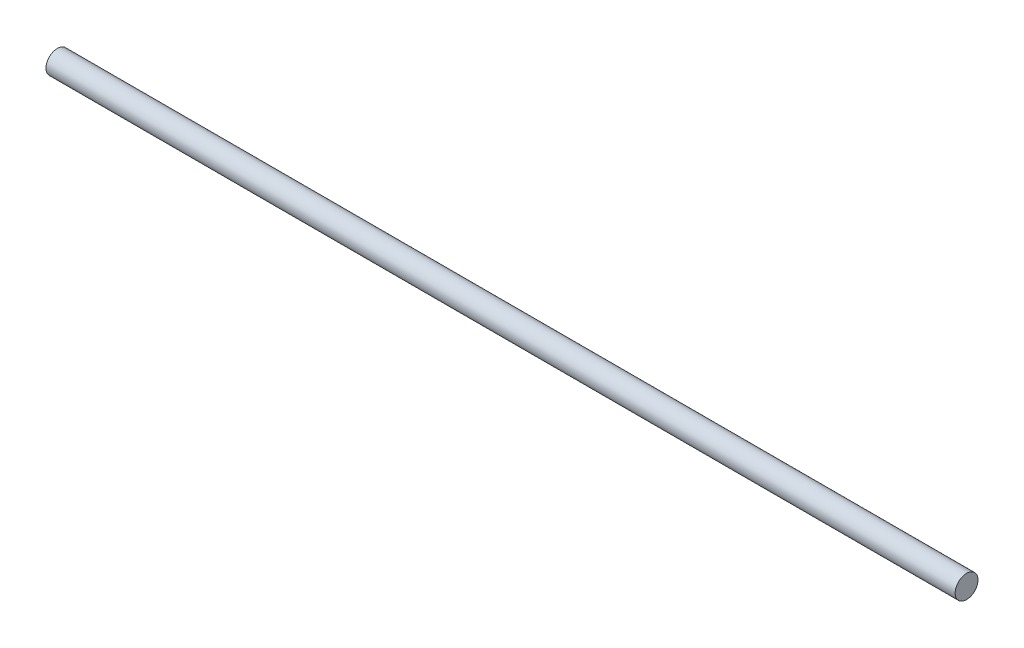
ISO-10303-21;
HEADER;
FILE_DESCRIPTION(('STEP AP214'),'2;1');
FILE_NAME('part.step','',(''),(''),'','','');
FILE_SCHEMA(('AUTOMOTIVE_DESIGN { 1 0 10303 214 1 1 1 1 }'));
ENDSEC;
DATA;
#1=APPLICATION_CONTEXT('core data for automotive mechanical design processes');
#2=APPLICATION_PROTOCOL_DEFINITION('international standard','automotive_design',2000,#1);
#3=PRODUCT_CONTEXT('',#1,'mechanical');
#4=PRODUCT('Part','Part','',(#3));
#5=PRODUCT_RELATED_PRODUCT_CATEGORY('part','',(#4));
#6=PRODUCT_DEFINITION_FORMATION('','',#4);
#7=PRODUCT_DEFINITION_CONTEXT('part definition',#1,'design');
#8=PRODUCT_DEFINITION('design','',#6,#7);
#9=PRODUCT_DEFINITION_SHAPE('','',#8);
#10=(LENGTH_UNIT() NAMED_UNIT(*) SI_UNIT(.MILLI.,.METRE.));
#11=(NAMED_UNIT(*) PLANE_ANGLE_UNIT() SI_UNIT($,.RADIAN.));
#12=(NAMED_UNIT(*) SI_UNIT($,.STERADIAN.) SOLID_ANGLE_UNIT());
#13=UNCERTAINTY_MEASURE_WITH_UNIT(LENGTH_MEASURE(1.E-05),#10,'distance_accuracy_value','');
#14=(GEOMETRIC_REPRESENTATION_CONTEXT(3) GLOBAL_UNCERTAINTY_ASSIGNED_CONTEXT((#13)) GLOBAL_UNIT_ASSIGNED_CONTEXT((#10,
#11,#12)) REPRESENTATION_CONTEXT('',''));
#15=CARTESIAN_POINT('',(0.,0.,0.));
#16=DIRECTION('',(0.,0.,1.));
#17=DIRECTION('',(1.,0.,0.));
#18=AXIS2_PLACEMENT_3D('',#15,#16,#17);
#19=CARTESIAN_POINT('',(632.46,0.,0.));
#20=DIRECTION('',(-1.,0.,0.));
#21=DIRECTION('',(0.,0.,1.));
#22=AXIS2_PLACEMENT_3D('',#19,#20,#21);
#23=CYLINDRICAL_SURFACE('',#22,7.9375);
#24=CARTESIAN_POINT('',(632.46,0.,0.));
#25=DIRECTION('',(1.,0.,0.));
#26=DIRECTION('',(0.,0.,-1.));
#27=AXIS2_PLACEMENT_3D('',#24,#25,#26);
#28=CIRCLE('',#27,7.9375);
#29=CARTESIAN_POINT('',(632.46,0.,-7.9375));
#30=VERTEX_POINT('',#29);
#31=EDGE_CURVE('E10',#30,#30,#28,.T.);
#32=ORIENTED_EDGE('',*,*,#31,.F.);
#33=EDGE_LOOP('',(#32));
#34=FACE_BOUND('',#33,.T.);
#35=CARTESIAN_POINT('',(0.,0.,0.));
#36=DIRECTION('',(1.,0.,0.));
#37=DIRECTION('',(0.,0.,-1.));
#38=AXIS2_PLACEMENT_3D('',#35,#36,#37);
#39=CIRCLE('',#38,7.9375);
#40=CARTESIAN_POINT('',(0.,0.,-7.9375));
#41=VERTEX_POINT('',#40);
#42=EDGE_CURVE('E32',#41,#41,#39,.T.);
#43=ORIENTED_EDGE('',*,*,#42,.T.);
#44=EDGE_LOOP('',(#43));
#45=FACE_BOUND('',#44,.T.);
#46=ADVANCED_FACE('F29',(#34,#45),#23,.T.);
#47=CARTESIAN_POINT('',(632.46,0.,0.));
#48=DIRECTION('',(1.,0.,0.));
#49=DIRECTION('',(0.,0.,-1.));
#50=AXIS2_PLACEMENT_3D('',#47,#48,#49);
#51=PLANE('',#50);
#52=ORIENTED_EDGE('',*,*,#31,.T.);
#53=EDGE_LOOP('',(#52));
#54=FACE_BOUND('',#53,.T.);
#55=ADVANCED_FACE('F44',(#54),#51,.T.);
#56=CARTESIAN_POINT('',(0.,0.,0.));
#57=DIRECTION('',(1.,0.,0.));
#58=DIRECTION('',(0.,0.,-1.));
#59=AXIS2_PLACEMENT_3D('',#56,#57,#58);
#60=PLANE('',#59);
#61=ORIENTED_EDGE('',*,*,#42,.F.);
#62=EDGE_LOOP('',(#61));
#63=FACE_BOUND('',#62,.T.);
#64=ADVANCED_FACE('F42',(#63),#60,.F.);
#65=CLOSED_SHELL('',(#46,#55,#64));
#66=MANIFOLD_SOLID_BREP('B2',#65);
#67=ADVANCED_BREP_SHAPE_REPRESENTATION('',(#18,#66),#14);
#68=SHAPE_DEFINITION_REPRESENTATION(#9,#67);
ENDSEC;
END-ISO-10303-21;
